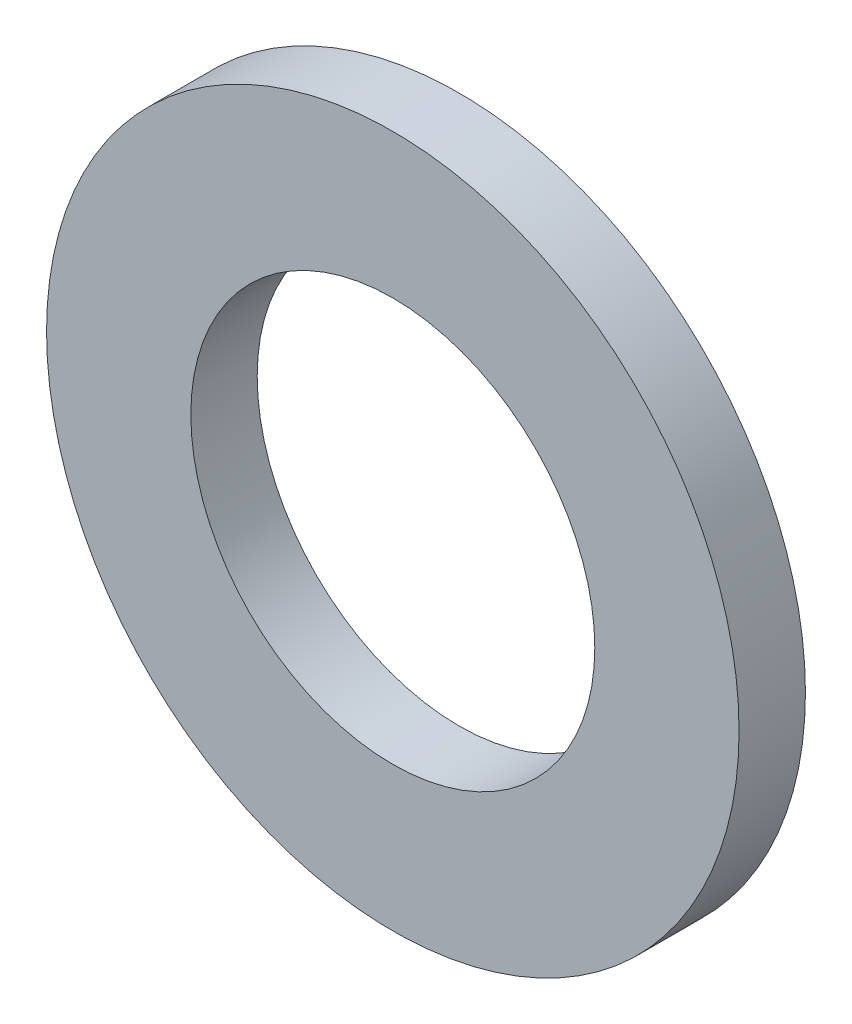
ISO-10303-21;
HEADER;
FILE_DESCRIPTION(('STEP AP214'),'2;1');
FILE_NAME('part.step','',(''),(''),'','','');
FILE_SCHEMA(('AUTOMOTIVE_DESIGN { 1 0 10303 214 1 1 1 1 }'));
ENDSEC;
DATA;
#1=APPLICATION_CONTEXT('core data for automotive mechanical design processes');
#2=APPLICATION_PROTOCOL_DEFINITION('international standard','automotive_design',2000,#1);
#3=PRODUCT_CONTEXT('',#1,'mechanical');
#4=PRODUCT('Part','Part','',(#3));
#5=PRODUCT_RELATED_PRODUCT_CATEGORY('part','',(#4));
#6=PRODUCT_DEFINITION_FORMATION('','',#4);
#7=PRODUCT_DEFINITION_CONTEXT('part definition',#1,'design');
#8=PRODUCT_DEFINITION('design','',#6,#7);
#9=PRODUCT_DEFINITION_SHAPE('','',#8);
#10=(LENGTH_UNIT() NAMED_UNIT(*) SI_UNIT(.MILLI.,.METRE.));
#11=(NAMED_UNIT(*) PLANE_ANGLE_UNIT() SI_UNIT($,.RADIAN.));
#12=(NAMED_UNIT(*) SI_UNIT($,.STERADIAN.) SOLID_ANGLE_UNIT());
#13=UNCERTAINTY_MEASURE_WITH_UNIT(LENGTH_MEASURE(1.E-05),#10,'distance_accuracy_value','');
#14=(GEOMETRIC_REPRESENTATION_CONTEXT(3) GLOBAL_UNCERTAINTY_ASSIGNED_CONTEXT((#13)) GLOBAL_UNIT_ASSIGNED_CONTEXT((#10,
#11,#12)) REPRESENTATION_CONTEXT('',''));
#15=CARTESIAN_POINT('',(0.,0.,0.));
#16=DIRECTION('',(0.,0.,1.));
#17=DIRECTION('',(1.,0.,0.));
#18=AXIS2_PLACEMENT_3D('',#15,#16,#17);
#19=CARTESIAN_POINT('',(0.,0.,0.));
#20=DIRECTION('',(0.,0.,1.));
#21=DIRECTION('',(1.,0.,0.));
#22=AXIS2_PLACEMENT_3D('',#19,#20,#21);
#23=PLANE('',#22);
#24=CARTESIAN_POINT('',(0.,0.,0.));
#25=DIRECTION('',(0.,0.,1.));
#26=DIRECTION('',(1.,0.,0.));
#27=AXIS2_PLACEMENT_3D('',#24,#25,#26);
#28=CIRCLE('',#27,12.);
#29=CARTESIAN_POINT('',(12.,0.,0.));
#30=VERTEX_POINT('',#29);
#31=EDGE_CURVE('E19',#30,#30,#28,.T.);
#32=ORIENTED_EDGE('',*,*,#31,.F.);
#33=EDGE_LOOP('',(#32));
#34=FACE_BOUND('',#33,.T.);
#35=CARTESIAN_POINT('',(0.,0.,0.));
#36=DIRECTION('',(0.,0.,1.));
#37=DIRECTION('',(0.,-1.,0.));
#38=AXIS2_PLACEMENT_3D('',#35,#36,#37);
#39=CIRCLE('',#38,7.);
#40=CARTESIAN_POINT('',(0.,-7.,0.));
#41=VERTEX_POINT('',#40);
#42=EDGE_CURVE('E27',#41,#41,#39,.T.);
#43=ORIENTED_EDGE('',*,*,#42,.T.);
#44=EDGE_LOOP('',(#43));
#45=FACE_BOUND('',#44,.T.);
#46=ADVANCED_FACE('F12',(#34,#45),#23,.F.);
#47=CARTESIAN_POINT('',(0.,0.,2.3));
#48=DIRECTION('',(0.,0.,1.));
#49=DIRECTION('',(1.,0.,0.));
#50=AXIS2_PLACEMENT_3D('',#47,#48,#49);
#51=PLANE('',#50);
#52=CARTESIAN_POINT('',(0.,0.,2.3));
#53=DIRECTION('',(0.,0.,1.));
#54=DIRECTION('',(1.,0.,0.));
#55=AXIS2_PLACEMENT_3D('',#52,#53,#54);
#56=CIRCLE('',#55,12.);
#57=CARTESIAN_POINT('',(12.,0.,2.3));
#58=VERTEX_POINT('',#57);
#59=EDGE_CURVE('E8',#58,#58,#56,.T.);
#60=ORIENTED_EDGE('',*,*,#59,.T.);
#61=EDGE_LOOP('',(#60));
#62=FACE_BOUND('',#61,.T.);
#63=CARTESIAN_POINT('',(0.,0.,2.3));
#64=DIRECTION('',(0.,0.,1.));
#65=DIRECTION('',(1.,0.,0.));
#66=AXIS2_PLACEMENT_3D('',#63,#64,#65);
#67=CIRCLE('',#66,7.);
#68=CARTESIAN_POINT('',(7.,0.,2.3));
#69=VERTEX_POINT('',#68);
#70=EDGE_CURVE('E23',#69,#69,#67,.T.);
#71=ORIENTED_EDGE('',*,*,#70,.F.);
#72=EDGE_LOOP('',(#71));
#73=FACE_BOUND('',#72,.T.);
#74=ADVANCED_FACE('F43',(#62,#73),#51,.T.);
#75=CARTESIAN_POINT('',(0.,0.,2.3));
#76=DIRECTION('',(0.,0.,-1.));
#77=DIRECTION('',(-1.,0.,0.));
#78=AXIS2_PLACEMENT_3D('',#75,#76,#77);
#79=CYLINDRICAL_SURFACE('',#78,12.);
#80=ORIENTED_EDGE('',*,*,#59,.F.);
#81=EDGE_LOOP('',(#80));
#82=FACE_BOUND('',#81,.T.);
#83=ORIENTED_EDGE('',*,*,#31,.T.);
#84=EDGE_LOOP('',(#83));
#85=FACE_BOUND('',#84,.T.);
#86=ADVANCED_FACE('F14',(#82,#85),#79,.T.);
#87=CARTESIAN_POINT('',(0.,0.,2.3));
#88=DIRECTION('',(0.,0.,-1.));
#89=DIRECTION('',(-1.,0.,0.));
#90=AXIS2_PLACEMENT_3D('',#87,#88,#89);
#91=CYLINDRICAL_SURFACE('',#90,7.);
#92=ORIENTED_EDGE('',*,*,#70,.T.);
#93=EDGE_LOOP('',(#92));
#94=FACE_BOUND('',#93,.T.);
#95=ORIENTED_EDGE('',*,*,#42,.F.);
#96=EDGE_LOOP('',(#95));
#97=FACE_BOUND('',#96,.T.);
#98=ADVANCED_FACE('F34',(#94,#97),#91,.F.);
#99=CLOSED_SHELL('',(#46,#74,#86,#98));
#100=MANIFOLD_SOLID_BREP('B1',#99);
#101=ADVANCED_BREP_SHAPE_REPRESENTATION('',(#18,#100),#14);
#102=SHAPE_DEFINITION_REPRESENTATION(#9,#101);
ENDSEC;
END-ISO-10303-21;
